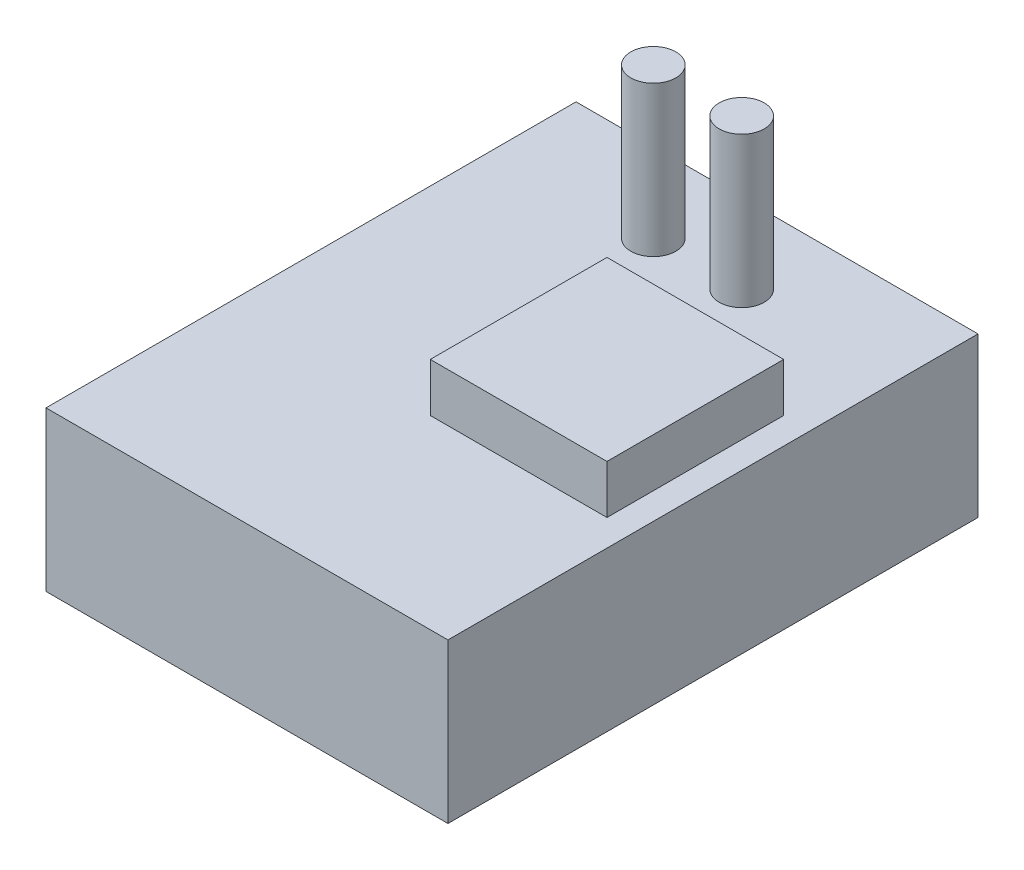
from build123d import *

# Parameters (mm, degrees)
ESBO_O1_W                = 91
ESBO_O1_H                = 120
RESSALTO_EXTRUS_O1_DEPTH = 36
ESBO_O2_W                = 40
ESBO_O2_H                = 40
RESSALTO_EXTRUS_O2_DEPTH = 11
ESBO_O3_R                = 5.1
RESSALTO_EXTRUS_O3_DEPTH = 34


with BuildPart() as part:
    # Esbo_o1 → Ressalto-extrus_o1 (new body)
    with BuildSketch(Plane(origin=(0, 0, 0), x_dir=(1, 0, 0), z_dir=(0, 1, 0))):
        Rectangle(ESBO_O1_W, ESBO_O1_H)
    extrude(amount=RESSALTO_EXTRUS_O1_DEPTH)

    # Esbo_o2 → Ressalto-extrus_o2 (add)
    with BuildSketch(Plane(origin=(0, 36, 0), x_dir=(1, 0, 0), z_dir=(0, 1, 0))):
        with Locations((19.5, 2)):
            Rectangle(ESBO_O2_W, ESBO_O2_H)
    extrude(amount=RESSALTO_EXTRUS_O2_DEPTH)

    # Esbo_o3 → Ressalto-extrus_o3 (add)
    with BuildSketch(Plane(origin=(0, 36, 0), x_dir=(1, 0, 0), z_dir=(0, 1, 0))):
        with Locations(Location((-10, 42, 0), (0, 0, 270))):
            Circle(ESBO_O3_R)
        with Locations(Location((10, 42, 0), (0, 0, 270))):
            Circle(ESBO_O3_R)
    extrude(amount=RESSALTO_EXTRUS_O3_DEPTH)


solid = part.part
